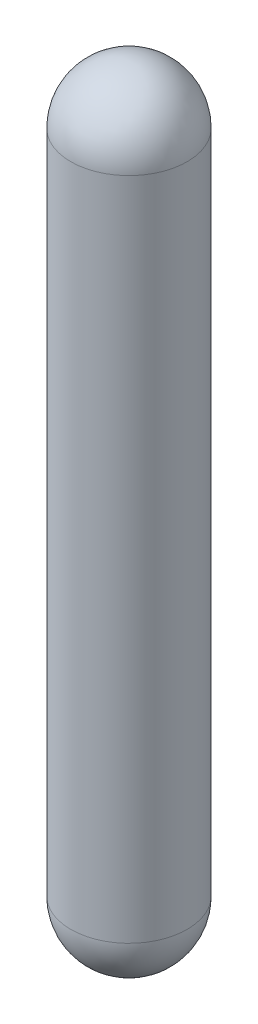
ISO-10303-21;
HEADER;
FILE_DESCRIPTION(('STEP AP214'),'2;1');
FILE_NAME('part.step','',(''),(''),'','','');
FILE_SCHEMA(('AUTOMOTIVE_DESIGN { 1 0 10303 214 1 1 1 1 }'));
ENDSEC;
DATA;
#1=APPLICATION_CONTEXT('core data for automotive mechanical design processes');
#2=APPLICATION_PROTOCOL_DEFINITION('international standard','automotive_design',2000,#1);
#3=PRODUCT_CONTEXT('',#1,'mechanical');
#4=PRODUCT('Part','Part','',(#3));
#5=PRODUCT_RELATED_PRODUCT_CATEGORY('part','',(#4));
#6=PRODUCT_DEFINITION_FORMATION('','',#4);
#7=PRODUCT_DEFINITION_CONTEXT('part definition',#1,'design');
#8=PRODUCT_DEFINITION('design','',#6,#7);
#9=PRODUCT_DEFINITION_SHAPE('','',#8);
#10=(LENGTH_UNIT() NAMED_UNIT(*) SI_UNIT(.MILLI.,.METRE.));
#11=(NAMED_UNIT(*) PLANE_ANGLE_UNIT() SI_UNIT($,.RADIAN.));
#12=(NAMED_UNIT(*) SI_UNIT($,.STERADIAN.) SOLID_ANGLE_UNIT());
#13=UNCERTAINTY_MEASURE_WITH_UNIT(LENGTH_MEASURE(1.E-05),#10,'distance_accuracy_value','');
#14=(GEOMETRIC_REPRESENTATION_CONTEXT(3) GLOBAL_UNCERTAINTY_ASSIGNED_CONTEXT((#13)) GLOBAL_UNIT_ASSIGNED_CONTEXT((#10,
#11,#12)) REPRESENTATION_CONTEXT('',''));
#15=CARTESIAN_POINT('',(0.,0.,0.));
#16=DIRECTION('',(0.,0.,1.));
#17=DIRECTION('',(1.,0.,0.));
#18=AXIS2_PLACEMENT_3D('',#15,#16,#17);
#19=CARTESIAN_POINT('',(0.,25.4,0.));
#20=DIRECTION('',(0.,-1.,0.));
#21=DIRECTION('',(0.,0.,-1.));
#22=AXIS2_PLACEMENT_3D('',#19,#20,#21);
#23=CYLINDRICAL_SURFACE('',#22,2.2225);
#24=CARTESIAN_POINT('',(0.,25.4,0.));
#25=DIRECTION('',(0.,1.,0.));
#26=DIRECTION('',(0.,0.,1.));
#27=AXIS2_PLACEMENT_3D('',#24,#25,#26);
#28=CIRCLE('',#27,2.2225);
#29=CARTESIAN_POINT('',(0.,25.4,2.2225));
#30=VERTEX_POINT('',#29);
#31=EDGE_CURVE('E10',#30,#30,#28,.T.);
#32=ORIENTED_EDGE('',*,*,#31,.F.);
#33=EDGE_LOOP('',(#32));
#34=FACE_BOUND('',#33,.T.);
#35=CARTESIAN_POINT('',(0.,0.,0.));
#36=DIRECTION('',(0.,1.,0.));
#37=DIRECTION('',(0.,0.,1.));
#38=AXIS2_PLACEMENT_3D('',#35,#36,#37);
#39=CIRCLE('',#38,2.2225);
#40=CARTESIAN_POINT('',(0.,0.,2.2225));
#41=VERTEX_POINT('',#40);
#42=EDGE_CURVE('E37',#41,#41,#39,.T.);
#43=ORIENTED_EDGE('',*,*,#42,.T.);
#44=EDGE_LOOP('',(#43));
#45=FACE_BOUND('',#44,.T.);
#46=ADVANCED_FACE('F31',(#34,#45),#23,.T.);
#47=CARTESIAN_POINT('',(0.,25.4,0.));
#48=DIRECTION('',(-1.,0.,0.));
#49=DIRECTION('',(0.,0.,1.));
#50=AXIS2_PLACEMENT_3D('',#47,#48,#49);
#51=SPHERICAL_SURFACE('',#50,2.2225);
#52=CARTESIAN_POINT('',(0.,25.4,0.));
#53=DIRECTION('',(0.,1.,0.));
#54=DIRECTION('',(0.,0.,1.));
#55=AXIS2_PLACEMENT_3D('',#52,#53,#54);
#56=SPHERICAL_SURFACE('',#55,2.2225);
#57=ORIENTED_EDGE('',*,*,#31,.T.);
#58=EDGE_LOOP('',(#57));
#59=FACE_BOUND('',#58,.T.);
#60=ADVANCED_FACE('F46',(#59),#56,.T.);
#61=CARTESIAN_POINT('',(0.,0.,0.));
#62=DIRECTION('',(1.,0.,0.));
#63=DIRECTION('',(0.,0.,1.));
#64=AXIS2_PLACEMENT_3D('',#61,#62,#63);
#65=SPHERICAL_SURFACE('',#64,2.2225);
#66=CARTESIAN_POINT('',(0.,0.,0.));
#67=DIRECTION('',(0.,1.,0.));
#68=DIRECTION('',(0.,0.,1.));
#69=AXIS2_PLACEMENT_3D('',#66,#67,#68);
#70=SPHERICAL_SURFACE('',#69,2.2225);
#71=ORIENTED_EDGE('',*,*,#42,.F.);
#72=EDGE_LOOP('',(#71));
#73=FACE_BOUND('',#72,.T.);
#74=ADVANCED_FACE('F44',(#73),#70,.T.);
#75=CLOSED_SHELL('',(#46,#60,#74));
#76=MANIFOLD_SOLID_BREP('B2',#75);
#77=ADVANCED_BREP_SHAPE_REPRESENTATION('',(#18,#76),#14);
#78=SHAPE_DEFINITION_REPRESENTATION(#9,#77);
ENDSEC;
END-ISO-10303-21;
